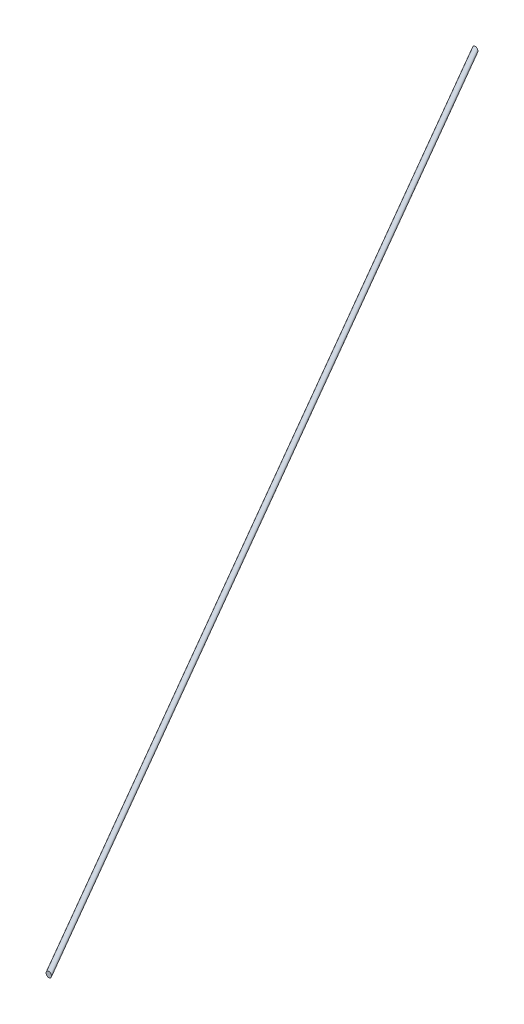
ISO-10303-21;
HEADER;
FILE_DESCRIPTION(('STEP AP214'),'2;1');
FILE_NAME('part.step','',(''),(''),'','','');
FILE_SCHEMA(('AUTOMOTIVE_DESIGN { 1 0 10303 214 1 1 1 1 }'));
ENDSEC;
DATA;
#1=APPLICATION_CONTEXT('core data for automotive mechanical design processes');
#2=APPLICATION_PROTOCOL_DEFINITION('international standard','automotive_design',2000,#1);
#3=PRODUCT_CONTEXT('',#1,'mechanical');
#4=PRODUCT('Part','Part','',(#3));
#5=PRODUCT_RELATED_PRODUCT_CATEGORY('part','',(#4));
#6=PRODUCT_DEFINITION_FORMATION('','',#4);
#7=PRODUCT_DEFINITION_CONTEXT('part definition',#1,'design');
#8=PRODUCT_DEFINITION('design','',#6,#7);
#9=PRODUCT_DEFINITION_SHAPE('','',#8);
#10=(LENGTH_UNIT() NAMED_UNIT(*) SI_UNIT(.MILLI.,.METRE.));
#11=(NAMED_UNIT(*) PLANE_ANGLE_UNIT() SI_UNIT($,.RADIAN.));
#12=(NAMED_UNIT(*) SI_UNIT($,.STERADIAN.) SOLID_ANGLE_UNIT());
#13=UNCERTAINTY_MEASURE_WITH_UNIT(LENGTH_MEASURE(1.E-05),#10,'distance_accuracy_value','');
#14=(GEOMETRIC_REPRESENTATION_CONTEXT(3) GLOBAL_UNCERTAINTY_ASSIGNED_CONTEXT((#13)) GLOBAL_UNIT_ASSIGNED_CONTEXT((#10,
#11,#12)) REPRESENTATION_CONTEXT('',''));
#15=CARTESIAN_POINT('',(0.,0.,0.));
#16=DIRECTION('',(0.,0.,1.));
#17=DIRECTION('',(1.,0.,0.));
#18=AXIS2_PLACEMENT_3D('',#15,#16,#17);
#19=CARTESIAN_POINT('',(11.9,-5.49999999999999,0.));
#20=DIRECTION('',(0.,0.,1.));
#21=DIRECTION('',(1.,0.,0.));
#22=AXIS2_PLACEMENT_3D('',#19,#20,#21);
#23=PLANE('',#22);
#24=CARTESIAN_POINT('',(12.775,-5.49999999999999,0.));
#25=CARTESIAN_POINT('',(12.7749959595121,-5.45087915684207,0.));
#26=CARTESIAN_POINT('',(12.7708484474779,-5.4017137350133,0.));
#27=CARTESIAN_POINT('',(12.7543483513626,-5.30469465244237,0.));
#28=CARTESIAN_POINT('',(12.7419782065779,-5.25684402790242,0.));
#29=CARTESIAN_POINT('',(12.7093897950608,-5.16394639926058,0.));
#30=CARTESIAN_POINT('',(12.6891800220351,-5.11889642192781,0.));
#31=CARTESIAN_POINT('',(12.6414835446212,-5.03282942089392,0.));
#32=CARTESIAN_POINT('',(12.6139966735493,-4.99181248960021,0.));
#33=CARTESIAN_POINT('',(12.5525285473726,-4.91497718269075,0.));
#34=CARTESIAN_POINT('',(12.5185476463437,-4.87915852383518,0.));
#35=CARTESIAN_POINT('',(12.4450517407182,-4.81373150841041,0.));
#36=CARTESIAN_POINT('',(12.405536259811,-4.78412368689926,0.));
#37=CARTESIAN_POINT('',(12.3220968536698,-4.73196364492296,0.));
#38=CARTESIAN_POINT('',(12.2781730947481,-4.70941115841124,0.));
#39=CARTESIAN_POINT('',(12.1871632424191,-4.67200070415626,0.));
#40=CARTESIAN_POINT('',(12.1400771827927,-4.65714265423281,0.));
#41=CARTESIAN_POINT('',(12.0440786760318,-4.63554241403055,0.));
#42=CARTESIAN_POINT('',(11.9951662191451,-4.62880026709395,0.));
#43=CARTESIAN_POINT('',(11.8969036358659,-4.62362337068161,0.));
#44=CARTESIAN_POINT('',(11.8475535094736,-4.62518862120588,0.));
#45=CARTESIAN_POINT('',(11.7498167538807,-4.6365820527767,0.));
#46=CARTESIAN_POINT('',(11.7014301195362,-4.64641018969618,0.));
#47=CARTESIAN_POINT('',(11.6069931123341,-4.67405050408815,0.));
#48=CARTESIAN_POINT('',(11.5609427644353,-4.69186276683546,0.));
#49=CARTESIAN_POINT('',(11.4724844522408,-4.73496649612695,0.));
#50=CARTESIAN_POINT('',(11.4300766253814,-4.76025824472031,0.));
#51=CARTESIAN_POINT('',(11.3501127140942,-4.81760033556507,0.));
#52=CARTESIAN_POINT('',(11.312556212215,-4.84965009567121,0.));
#53=CARTESIAN_POINT('',(11.2433547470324,-4.91960116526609,0.));
#54=CARTESIAN_POINT('',(11.211710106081,-4.9575027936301,0.));
#55=CARTESIAN_POINT('',(11.1552340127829,-5.03808153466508,0.));
#56=CARTESIAN_POINT('',(11.1304024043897,-5.08075853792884,0.));
#57=CARTESIAN_POINT('',(11.0882329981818,-5.16971760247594,0.));
#58=CARTESIAN_POINT('',(11.0709033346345,-5.21600351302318,0.));
#59=CARTESIAN_POINT('',(11.0443001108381,-5.31075172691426,0.));
#60=CARTESIAN_POINT('',(11.0350094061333,-5.35920916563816,0.));
#61=CARTESIAN_POINT('',(11.0266144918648,-5.43859739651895,0.));
#62=CARTESIAN_POINT('',(11.0249974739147,-5.46928998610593,0.));
#63=CARTESIAN_POINT('',(11.025004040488,-5.54912084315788,0.));
#64=CARTESIAN_POINT('',(11.0291515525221,-5.59828626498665,0.));
#65=CARTESIAN_POINT('',(11.0456516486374,-5.69530534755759,0.));
#66=CARTESIAN_POINT('',(11.0580217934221,-5.74315597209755,0.));
#67=CARTESIAN_POINT('',(11.0906102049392,-5.83605360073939,0.));
#68=CARTESIAN_POINT('',(11.110819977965,-5.88110357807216,0.));
#69=CARTESIAN_POINT('',(11.1585164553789,-5.96717057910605,0.));
#70=CARTESIAN_POINT('',(11.1860033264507,-6.00818751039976,0.));
#71=CARTESIAN_POINT('',(11.2474714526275,-6.08502281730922,0.));
#72=CARTESIAN_POINT('',(11.2814523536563,-6.12084147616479,0.));
#73=CARTESIAN_POINT('',(11.3549482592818,-6.18626849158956,0.));
#74=CARTESIAN_POINT('',(11.394463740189,-6.21587631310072,0.));
#75=CARTESIAN_POINT('',(11.4779031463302,-6.26803635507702,0.));
#76=CARTESIAN_POINT('',(11.5218269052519,-6.29058884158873,0.));
#77=CARTESIAN_POINT('',(11.6128367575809,-6.32799929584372,0.));
#78=CARTESIAN_POINT('',(11.6599228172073,-6.34285734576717,0.));
#79=CARTESIAN_POINT('',(11.7559213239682,-6.36445758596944,0.));
#80=CARTESIAN_POINT('',(11.8048337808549,-6.37119973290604,0.));
#81=CARTESIAN_POINT('',(11.903096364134,-6.37637662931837,0.));
#82=CARTESIAN_POINT('',(11.9524464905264,-6.37481137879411,0.));
#83=CARTESIAN_POINT('',(12.0501832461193,-6.36341794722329,0.));
#84=CARTESIAN_POINT('',(12.0985698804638,-6.35358981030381,0.));
#85=CARTESIAN_POINT('',(12.1930068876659,-6.32594949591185,0.));
#86=CARTESIAN_POINT('',(12.2390572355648,-6.30813723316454,0.));
#87=CARTESIAN_POINT('',(12.3275155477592,-6.26503350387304,0.));
#88=CARTESIAN_POINT('',(12.3699233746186,-6.23974175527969,0.));
#89=CARTESIAN_POINT('',(12.4498872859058,-6.18239966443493,0.));
#90=CARTESIAN_POINT('',(12.487443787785,-6.15034990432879,0.));
#91=CARTESIAN_POINT('',(12.5566452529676,-6.08039883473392,0.));
#92=CARTESIAN_POINT('',(12.588289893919,-6.04249720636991,0.));
#93=CARTESIAN_POINT('',(12.6447659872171,-5.96191846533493,0.));
#94=CARTESIAN_POINT('',(12.6695975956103,-5.91924146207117,0.));
#95=CARTESIAN_POINT('',(12.7117670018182,-5.83028239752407,0.));
#96=CARTESIAN_POINT('',(12.7290966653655,-5.78399648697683,0.));
#97=CARTESIAN_POINT('',(12.7556998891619,-5.68924827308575,0.));
#98=CARTESIAN_POINT('',(12.7649905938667,-5.64079083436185,0.));
#99=CARTESIAN_POINT('',(12.7733855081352,-5.56140260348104,0.));
#100=CARTESIAN_POINT('',(12.7750025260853,-5.53071001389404,0.));
#101=CARTESIAN_POINT('',(12.775,-5.49999999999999,0.));
#102=B_SPLINE_CURVE_WITH_KNOTS('',3,(#24,#25,#26,#27,#28,#29,#30,#31,#32,#33,#34,#35,#36,#37,
#38,#39,#40,#41,#42,#43,#44,#45,#46,#47,#48,#49,#50,#51,#52,#53,#54,#55,#56,#57,#58,#59,#60,#61,
#62,#63,#64,#65,#66,#67,#68,#69,#70,#71,#72,#73,#74,#75,#76,#77,#78,#79,#80,#81,#82,#83,#84,#85,
#86,#87,#88,#89,#90,#91,#92,#93,#94,#95,#96,#97,#98,#99,#100,#101),.UNSPECIFIED.,.T.,.F.,(4,2,2,
2,2,2,2,2,2,2,2,2,2,2,2,2,2,2,2,2,2,2,2,2,2,2,2,2,2,2,2,2,2,2,2,2,2,2,4),(0.,0.147266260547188,
0.294848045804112,0.44227038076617,0.589696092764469,0.737113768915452,0.88454413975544,
1.03196895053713,1.17939218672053,1.32681621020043,1.47424023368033,1.62166346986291,
1.76908828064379,1.91651865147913,2.06393632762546,2.21136203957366,2.35878437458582,
2.5063661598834,2.65363242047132,2.74570227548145,2.89296853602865,3.04055032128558,
3.18797265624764,3.33539836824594,3.48281604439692,3.63024641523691,3.7776712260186,
3.92509446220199,4.07251848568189,4.2199425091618,4.36736574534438,4.51479055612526,
4.6622209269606,4.80963860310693,4.95706431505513,5.10448665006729,5.25206843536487,
5.39933469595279,5.49140455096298),.UNSPECIFIED.);
#103=CARTESIAN_POINT('',(12.775,-5.49999999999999,0.));
#104=VERTEX_POINT('',#103);
#105=EDGE_CURVE('E19',#104,#104,#102,.T.);
#106=ORIENTED_EDGE('',*,*,#105,.F.);
#107=EDGE_LOOP('',(#106));
#108=FACE_BOUND('',#107,.T.);
#109=ADVANCED_FACE('F15',(#108),#23,.F.);
#110=CARTESIAN_POINT('',(14.3451815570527,-192.671051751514,140.003714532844));
#111=DIRECTION('',(0.,0.,1.));
#112=DIRECTION('',(1.,0.,0.));
#113=AXIS2_PLACEMENT_3D('',#110,#111,#112);
#114=PLANE('',#113);
#115=CARTESIAN_POINT('',(13.4701815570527,-192.671051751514,140.003714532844));
#116=CARTESIAN_POINT('',(13.4701855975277,-192.621930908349,140.003714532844));
#117=CARTESIAN_POINT('',(13.474333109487,-192.57276548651,140.003714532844));
#118=CARTESIAN_POINT('',(13.4908332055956,-192.475746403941,140.003714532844));
#119=CARTESIAN_POINT('',(13.5032033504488,-192.427895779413,140.003714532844));
#120=CARTESIAN_POINT('',(13.535791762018,-192.334998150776,140.003714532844));
#121=CARTESIAN_POINT('',(13.5560015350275,-192.289948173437,140.003714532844));
#122=CARTESIAN_POINT('',(13.6036980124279,-192.2038811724,140.003714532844));
#123=CARTESIAN_POINT('',(13.6311848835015,-192.162864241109,140.003714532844));
#124=CARTESIAN_POINT('',(13.6926530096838,-192.086028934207,140.003714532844));
#125=CARTESIAN_POINT('',(13.7266339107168,-192.050210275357,140.003714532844));
#126=CARTESIAN_POINT('',(13.8001298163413,-191.984783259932,140.003714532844));
#127=CARTESIAN_POINT('',(13.8396452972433,-191.955175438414,140.003714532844));
#128=CARTESIAN_POINT('',(13.9230847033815,-191.903015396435,140.003714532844));
#129=CARTESIAN_POINT('',(13.9670084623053,-191.880462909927,140.003714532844));
#130=CARTESIAN_POINT('',(14.0580183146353,-191.843052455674,140.003714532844));
#131=CARTESIAN_POINT('',(14.1051043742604,-191.828194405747,140.003714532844));
#132=CARTESIAN_POINT('',(14.2011028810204,-191.806594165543,140.003714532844));
#133=CARTESIAN_POINT('',(14.2500153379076,-191.799852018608,140.003714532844));
#134=CARTESIAN_POINT('',(14.3482779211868,-191.794675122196,140.003714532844));
#135=CARTESIAN_POINT('',(14.3976280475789,-191.796240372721,140.003714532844));
#136=CARTESIAN_POINT('',(14.4953648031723,-191.807633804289,140.003714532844));
#137=CARTESIAN_POINT('',(14.5437514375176,-191.817461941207,140.003714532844));
#138=CARTESIAN_POINT('',(14.6381884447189,-191.8451022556,140.003714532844));
#139=CARTESIAN_POINT('',(14.6842387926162,-191.862914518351,140.003714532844));
#140=CARTESIAN_POINT('',(14.7726971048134,-191.906018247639,140.003714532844));
#141=CARTESIAN_POINT('',(14.8151049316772,-191.931309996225,140.003714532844));
#142=CARTESIAN_POINT('',(14.8950688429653,-191.988652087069,140.003714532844));
#143=CARTESIAN_POINT('',(14.9326253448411,-192.020701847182,140.003714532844));
#144=CARTESIAN_POINT('',(15.001826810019,-192.090652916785,140.003714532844));
#145=CARTESIAN_POINT('',(15.0334714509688,-192.128554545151,140.003714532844));
#146=CARTESIAN_POINT('',(15.0899475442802,-192.209133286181,140.003714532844));
#147=CARTESIAN_POINT('',(15.1147791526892,-192.251810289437,140.003714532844));
#148=CARTESIAN_POINT('',(15.1569485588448,-192.340769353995,140.003714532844));
#149=CARTESIAN_POINT('',(15.1742782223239,-192.387055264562,140.003714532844));
#150=CARTESIAN_POINT('',(15.200881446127,-192.481803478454,140.003714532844));
#151=CARTESIAN_POINT('',(15.2101721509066,-192.530260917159,140.003714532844));
#152=CARTESIAN_POINT('',(15.218567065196,-192.609649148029,140.003714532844));
#153=CARTESIAN_POINT('',(15.2201840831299,-192.640341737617,140.003714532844));
#154=CARTESIAN_POINT('',(15.2201775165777,-192.720172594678,140.003714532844));
#155=CARTESIAN_POINT('',(15.2160300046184,-192.769338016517,140.003714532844));
#156=CARTESIAN_POINT('',(15.1995299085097,-192.866357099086,140.003714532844));
#157=CARTESIAN_POINT('',(15.1871597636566,-192.914207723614,140.003714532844));
#158=CARTESIAN_POINT('',(15.1545713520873,-193.007105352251,140.003714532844));
#159=CARTESIAN_POINT('',(15.1343615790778,-193.05215532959,140.003714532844));
#160=CARTESIAN_POINT('',(15.0866651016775,-193.138222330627,140.003714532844));
#161=CARTESIAN_POINT('',(15.0591782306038,-193.179239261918,140.003714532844));
#162=CARTESIAN_POINT('',(14.9977101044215,-193.25607456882,140.003714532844));
#163=CARTESIAN_POINT('',(14.9637292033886,-193.29189322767,140.003714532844));
#164=CARTESIAN_POINT('',(14.8902332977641,-193.357320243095,140.003714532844));
#165=CARTESIAN_POINT('',(14.8507178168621,-193.386928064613,140.003714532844));
#166=CARTESIAN_POINT('',(14.7672784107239,-193.439088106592,140.003714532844));
#167=CARTESIAN_POINT('',(14.7233546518,-193.4616405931,140.003714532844));
#168=CARTESIAN_POINT('',(14.63234479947,-193.499051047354,140.003714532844));
#169=CARTESIAN_POINT('',(14.5852587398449,-193.51390909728,140.003714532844));
#170=CARTESIAN_POINT('',(14.4892602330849,-193.535509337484,140.003714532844));
#171=CARTESIAN_POINT('',(14.4403477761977,-193.542251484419,140.003714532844));
#172=CARTESIAN_POINT('',(14.3420851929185,-193.547428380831,140.003714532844));
#173=CARTESIAN_POINT('',(14.2927350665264,-193.545863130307,140.003714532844));
#174=CARTESIAN_POINT('',(14.194998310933,-193.534469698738,140.003714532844));
#175=CARTESIAN_POINT('',(14.1466116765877,-193.52464156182,140.003714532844));
#176=CARTESIAN_POINT('',(14.0521746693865,-193.497001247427,140.003714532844));
#177=CARTESIAN_POINT('',(14.0061243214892,-193.479188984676,140.003714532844));
#178=CARTESIAN_POINT('',(13.917666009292,-193.436085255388,140.003714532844));
#179=CARTESIAN_POINT('',(13.8752581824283,-193.410793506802,140.003714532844));
#180=CARTESIAN_POINT('',(13.7952942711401,-193.353451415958,140.003714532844));
#181=CARTESIAN_POINT('',(13.7577377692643,-193.321401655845,140.003714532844));
#182=CARTESIAN_POINT('',(13.6885363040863,-193.251450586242,140.003714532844));
#183=CARTESIAN_POINT('',(13.6568916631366,-193.213548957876,140.003714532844));
#184=CARTESIAN_POINT('',(13.6004155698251,-193.132970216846,140.003714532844));
#185=CARTESIAN_POINT('',(13.5755839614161,-193.09029321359,140.003714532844));
#186=CARTESIAN_POINT('',(13.5334145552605,-193.001334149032,140.003714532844));
#187=CARTESIAN_POINT('',(13.5160848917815,-192.955048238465,140.003714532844));
#188=CARTESIAN_POINT('',(13.4894816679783,-192.860300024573,140.003714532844));
#189=CARTESIAN_POINT('',(13.4801909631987,-192.811842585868,140.003714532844));
#190=CARTESIAN_POINT('',(13.4717960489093,-192.732454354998,140.003714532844));
#191=CARTESIAN_POINT('',(13.4701790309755,-192.70176176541,140.003714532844));
#192=CARTESIAN_POINT('',(13.4701815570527,-192.671051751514,140.003714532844));
#193=B_SPLINE_CURVE_WITH_KNOTS('',3,(#115,#116,#117,#118,#119,#120,#121,#122,#123,#124,#125,
#126,#127,#128,#129,#130,#131,#132,#133,#134,#135,#136,#137,#138,#139,#140,#141,#142,#143,#144,
#145,#146,#147,#148,#149,#150,#151,#152,#153,#154,#155,#156,#157,#158,#159,#160,#161,#162,#163,
#164,#165,#166,#167,#168,#169,#170,#171,#172,#173,#174,#175,#176,#177,#178,#179,#180,#181,#182,
#183,#184,#185,#186,#187,#188,#189,#190,#191,#192),.UNSPECIFIED.,.T.,.F.,(4,2,2,2,2,2,2,2,2,2,2,
2,2,2,2,2,2,2,2,2,2,2,2,2,2,2,2,2,2,2,2,2,2,2,2,2,2,2,4),(0.,0.147266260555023,
0.294848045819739,0.44227038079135,0.589696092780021,0.73711376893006,0.884544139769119,
1.03196895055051,1.17939218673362,1.32681621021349,1.47424023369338,1.62166346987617,
1.76908828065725,1.9165186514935,2.06393632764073,2.21136203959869,2.35878437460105,
2.50636615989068,2.65363242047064,2.74570227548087,2.89296853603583,3.04055032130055,
3.18797265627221,3.33539836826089,3.48281604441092,3.63024641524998,3.77767122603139,
3.92509446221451,4.07251848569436,4.2199425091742,4.36736574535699,4.51479055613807,
4.66222092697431,4.80963860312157,4.95706431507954,5.10448665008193,5.25206843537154,
5.3993346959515,5.49140455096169),.UNSPECIFIED.);
#194=CARTESIAN_POINT('',(15.2201815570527,-192.671051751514,140.003714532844));
#195=VERTEX_POINT('',#194);
#196=EDGE_CURVE('E10',#195,#195,#193,.T.);
#197=ORIENTED_EDGE('',*,*,#196,.F.);
#198=EDGE_LOOP('',(#197));
#199=FACE_BOUND('',#198,.T.);
#200=ADVANCED_FACE('F37',(#199),#114,.T.);
#201=CARTESIAN_POINT('',(12.775,-5.49999999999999,0.));
#202=CARTESIAN_POINT('',(15.2201815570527,-192.671051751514,140.003714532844));
#203=CARTESIAN_POINT('',(12.775,-3.74999999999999,0.));
#204=CARTESIAN_POINT('',(15.2201815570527,-190.921051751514,140.003714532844));
#205=CARTESIAN_POINT('',(11.025,-3.74999999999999,0.));
#206=CARTESIAN_POINT('',(13.4701815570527,-190.921051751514,140.003714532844));
#207=CARTESIAN_POINT('',(11.025,-5.49999999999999,0.));
#208=CARTESIAN_POINT('',(13.4701815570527,-192.671051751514,140.003714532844));
#209=CARTESIAN_POINT('',(11.025,-7.24999999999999,0.));
#210=CARTESIAN_POINT('',(13.4701815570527,-194.421051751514,140.003714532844));
#211=CARTESIAN_POINT('',(12.775,-7.24999999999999,0.));
#212=CARTESIAN_POINT('',(15.2201815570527,-194.421051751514,140.003714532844));
#213=CARTESIAN_POINT('',(12.775,-5.49999999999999,0.));
#214=CARTESIAN_POINT('',(15.2201815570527,-192.671051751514,140.003714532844));
#215=(BOUNDED_SURFACE() B_SPLINE_SURFACE(3,1,((#201,#202),(#203,#204),(#205,#206),(#207,#208),
(#209,#210),(#211,#212),(#213,#214)),.UNSPECIFIED.,.T.,.F.,.F.) B_SPLINE_SURFACE_WITH_KNOTS((4,
3,4),(2,2),(0.,0.5,1.),(0.,1.),
.UNSPECIFIED.) GEOMETRIC_REPRESENTATION_ITEM() RATIONAL_B_SPLINE_SURFACE(((1.,1.),
(0.333333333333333,0.333333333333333),(0.333333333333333,0.333333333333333),(1.,1.),
(0.333333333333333,0.333333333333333),(0.333333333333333,0.333333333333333),(1.,1.))) REPRESENTATION_ITEM('') SURFACE());
#216=CARTESIAN_POINT('',(15.2201815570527,-192.671051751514,140.003714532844));
#217=CARTESIAN_POINT('',(15.1947109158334,-190.721353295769,138.545342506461));
#218=CARTESIAN_POINT('',(15.1692402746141,-188.771654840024,137.086970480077));
#219=CARTESIAN_POINT('',(15.1182989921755,-184.872257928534,134.170226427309));
#220=CARTESIAN_POINT('',(15.0928283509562,-182.922559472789,132.711854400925));
#221=CARTESIAN_POINT('',(15.0418870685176,-179.023162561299,129.795110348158));
#222=CARTESIAN_POINT('',(15.0164164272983,-177.073464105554,128.336738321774));
#223=CARTESIAN_POINT('',(14.9654751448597,-173.174067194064,125.419994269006));
#224=CARTESIAN_POINT('',(14.9400045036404,-171.224368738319,123.961622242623));
#225=CARTESIAN_POINT('',(14.8890632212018,-167.324971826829,121.044878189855));
#226=CARTESIAN_POINT('',(14.8635925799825,-165.375273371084,119.586506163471));
#227=CARTESIAN_POINT('',(14.8126512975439,-161.475876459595,116.669762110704));
#228=CARTESIAN_POINT('',(14.7871806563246,-159.52617800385,115.21139008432));
#229=CARTESIAN_POINT('',(14.736239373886,-155.62678109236,112.294646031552));
#230=CARTESIAN_POINT('',(14.7107687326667,-153.677082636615,110.836274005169));
#231=CARTESIAN_POINT('',(14.6598274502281,-149.777685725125,107.919529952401));
#232=CARTESIAN_POINT('',(14.6343568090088,-147.82798726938,106.461157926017));
#233=CARTESIAN_POINT('',(14.5834155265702,-143.92859035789,103.54441387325));
#234=CARTESIAN_POINT('',(14.5579448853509,-141.978891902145,102.086041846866));
#235=CARTESIAN_POINT('',(14.5070036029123,-138.079494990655,99.1692977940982));
#236=CARTESIAN_POINT('',(14.481532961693,-136.12979653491,97.7109257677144));
#237=CARTESIAN_POINT('',(14.4305916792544,-132.230399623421,94.7941817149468));
#238=CARTESIAN_POINT('',(14.4051210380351,-130.280701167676,93.335809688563));
#239=CARTESIAN_POINT('',(14.3541797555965,-126.381304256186,90.4190656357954));
#240=CARTESIAN_POINT('',(14.3287091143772,-124.431605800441,88.9606936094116));
#241=CARTESIAN_POINT('',(14.2777678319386,-120.532208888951,86.043949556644));
#242=CARTESIAN_POINT('',(14.2522971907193,-118.582510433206,84.5855775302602));
#243=CARTESIAN_POINT('',(14.2013559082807,-114.683113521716,81.6688334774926));
#244=CARTESIAN_POINT('',(14.1758852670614,-112.733415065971,80.2104614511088));
#245=CARTESIAN_POINT('',(14.1249439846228,-108.834018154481,77.2937173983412));
#246=CARTESIAN_POINT('',(14.0994733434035,-106.884319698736,75.8353453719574));
#247=CARTESIAN_POINT('',(14.0485320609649,-102.984922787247,72.9186013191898));
#248=CARTESIAN_POINT('',(14.0230614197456,-101.035224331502,71.460229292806));
#249=CARTESIAN_POINT('',(13.972120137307,-97.1358274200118,68.5434852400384));
#250=CARTESIAN_POINT('',(13.9466494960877,-95.1861289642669,67.0851132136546));
#251=CARTESIAN_POINT('',(13.8957082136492,-91.286732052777,64.168369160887));
#252=CARTESIAN_POINT('',(13.8702375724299,-89.3370335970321,62.7099971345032));
#253=CARTESIAN_POINT('',(13.8192962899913,-85.4376366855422,59.7932530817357));
#254=CARTESIAN_POINT('',(13.793825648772,-83.4879382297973,58.3348810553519));
#255=CARTESIAN_POINT('',(13.7428843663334,-79.5885413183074,55.4181370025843));
#256=CARTESIAN_POINT('',(13.7174137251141,-77.6388428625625,53.9597649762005));
#257=CARTESIAN_POINT('',(13.6664724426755,-73.7394459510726,51.0430209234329));
#258=CARTESIAN_POINT('',(13.6410018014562,-71.7897474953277,49.5846488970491));
#259=CARTESIAN_POINT('',(13.5900605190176,-67.8903505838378,46.6679048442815));
#260=CARTESIAN_POINT('',(13.5645898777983,-65.9406521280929,45.2095328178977));
#261=CARTESIAN_POINT('',(13.5136485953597,-62.041255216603,42.2927887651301));
#262=CARTESIAN_POINT('',(13.4881779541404,-60.0915567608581,40.8344167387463));
#263=CARTESIAN_POINT('',(13.4372366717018,-56.1921598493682,37.9176726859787));
#264=CARTESIAN_POINT('',(13.4117660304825,-54.2424613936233,36.4593006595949));
#265=CARTESIAN_POINT('',(13.3608247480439,-50.3430644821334,33.5425566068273));
#266=CARTESIAN_POINT('',(13.3353541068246,-48.3933660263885,32.0841845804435));
#267=CARTESIAN_POINT('',(13.284412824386,-44.4939691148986,29.1674405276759));
#268=CARTESIAN_POINT('',(13.2589421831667,-42.5442706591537,27.7090685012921));
#269=CARTESIAN_POINT('',(13.2080009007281,-38.6448737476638,24.7923244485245));
#270=CARTESIAN_POINT('',(13.1825302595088,-36.6951752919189,23.3339524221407));
#271=CARTESIAN_POINT('',(13.1315889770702,-32.7957783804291,20.4172083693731));
#272=CARTESIAN_POINT('',(13.1061183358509,-30.8460799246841,18.9588363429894));
#273=CARTESIAN_POINT('',(13.0551770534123,-26.9466830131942,16.0420922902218));
#274=CARTESIAN_POINT('',(13.029706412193,-24.9969845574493,14.583720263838));
#275=CARTESIAN_POINT('',(12.9787651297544,-21.0975876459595,11.6669762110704));
#276=CARTESIAN_POINT('',(12.9532944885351,-19.1478891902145,10.2086041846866));
#277=CARTESIAN_POINT('',(12.9023532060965,-15.2484922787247,7.29186013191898));
#278=CARTESIAN_POINT('',(12.8768825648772,-13.2987938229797,5.83348810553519));
#279=CARTESIAN_POINT('',(12.8259412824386,-9.39939691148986,2.91674405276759));
#280=CARTESIAN_POINT('',(12.8004706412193,-7.44969845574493,1.4583720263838));
#281=CARTESIAN_POINT('',(12.775,-5.49999999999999,0.));
#282=B_SPLINE_CURVE_WITH_KNOTS('',3,(#216,#217,#218,#219,#220,#221,#222,#223,#224,#225,#226,
#227,#228,#229,#230,#231,#232,#233,#234,#235,#236,#237,#238,#239,#240,#241,#242,#243,#244,#245,
#246,#247,#248,#249,#250,#251,#252,#253,#254,#255,#256,#257,#258,#259,#260,#261,#262,#263,#264,
#265,#266,#267,#268,#269,#270,#271,#272,#273,#274,#275,#276,#277,#278,#279,#280,#281),
.UNSPECIFIED.,.F.,.F.,(4,2,2,2,2,2,2,2,2,2,2,2,2,2,2,2,2,2,2,2,2,2,2,2,2,2,2,2,2,2,2,2,4),(0.,
7.30475161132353,14.6095032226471,21.9142548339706,29.2190064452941,36.5237580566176,
43.8285096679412,51.1332612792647,58.4380128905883,65.7427645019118,73.0475161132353,
80.3522677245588,87.6570193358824,94.9617709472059,102.266522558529,109.571274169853,
116.876025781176,124.1807773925,131.485529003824,138.790280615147,146.095032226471,
153.399783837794,160.704535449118,168.009287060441,175.314038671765,182.618790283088,
189.923541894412,197.228293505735,204.533045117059,211.837796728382,219.142548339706,
226.447299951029,233.752051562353),.UNSPECIFIED.);
#283=EDGE_CURVE('BSEAM33',#195,#104,#282,.T.);
#284=ORIENTED_EDGE('',*,*,#196,.T.);
#285=ORIENTED_EDGE('',*,*,#105,.T.);
#286=ORIENTED_EDGE('',*,*,#283,.T.);
#287=ORIENTED_EDGE('',*,*,#283,.F.);
#288=EDGE_LOOP('',(#284,#286,#285,#287));
#289=FACE_BOUND('',#288,.T.);
#290=ADVANCED_FACE('F33',(#289),#215,.T.);
#291=CLOSED_SHELL('',(#109,#200,#290));
#292=MANIFOLD_SOLID_BREP('B1',#291);
#293=ADVANCED_BREP_SHAPE_REPRESENTATION('',(#18,#292),#14);
#294=SHAPE_DEFINITION_REPRESENTATION(#9,#293);
ENDSEC;
END-ISO-10303-21;
